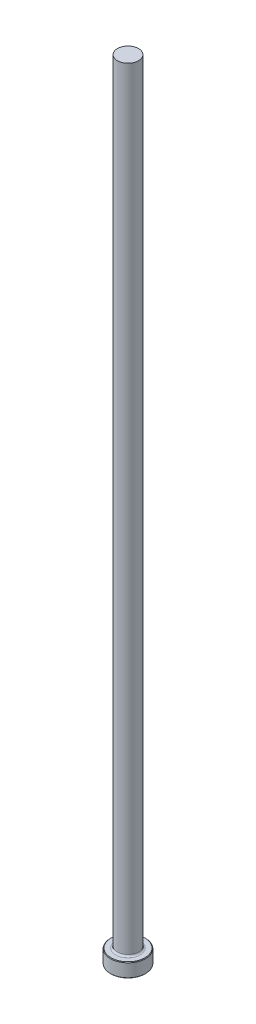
ISO-10303-21;
HEADER;
FILE_DESCRIPTION(('STEP AP214'),'2;1');
FILE_NAME('part.step','',(''),(''),'','','');
FILE_SCHEMA(('AUTOMOTIVE_DESIGN { 1 0 10303 214 1 1 1 1 }'));
ENDSEC;
DATA;
#1=APPLICATION_CONTEXT('core data for automotive mechanical design processes');
#2=APPLICATION_PROTOCOL_DEFINITION('international standard','automotive_design',2000,#1);
#3=PRODUCT_CONTEXT('',#1,'mechanical');
#4=PRODUCT('Part','Part','',(#3));
#5=PRODUCT_RELATED_PRODUCT_CATEGORY('part','',(#4));
#6=PRODUCT_DEFINITION_FORMATION('','',#4);
#7=PRODUCT_DEFINITION_CONTEXT('part definition',#1,'design');
#8=PRODUCT_DEFINITION('design','',#6,#7);
#9=PRODUCT_DEFINITION_SHAPE('','',#8);
#10=(LENGTH_UNIT() NAMED_UNIT(*) SI_UNIT(.MILLI.,.METRE.));
#11=(NAMED_UNIT(*) PLANE_ANGLE_UNIT() SI_UNIT($,.RADIAN.));
#12=(NAMED_UNIT(*) SI_UNIT($,.STERADIAN.) SOLID_ANGLE_UNIT());
#13=UNCERTAINTY_MEASURE_WITH_UNIT(LENGTH_MEASURE(1.E-05),#10,'distance_accuracy_value','');
#14=(GEOMETRIC_REPRESENTATION_CONTEXT(3) GLOBAL_UNCERTAINTY_ASSIGNED_CONTEXT((#13)) GLOBAL_UNIT_ASSIGNED_CONTEXT((#10,
#11,#12)) REPRESENTATION_CONTEXT('',''));
#15=CARTESIAN_POINT('',(0.,0.,0.));
#16=DIRECTION('',(0.,0.,1.));
#17=DIRECTION('',(1.,0.,0.));
#18=AXIS2_PLACEMENT_3D('',#15,#16,#17);
#19=CARTESIAN_POINT('',(0.,0.,0.));
#20=DIRECTION('',(0.,-1.,0.));
#21=DIRECTION('',(0.,0.,-1.));
#22=AXIS2_PLACEMENT_3D('',#19,#20,#21);
#23=PLANE('',#22);
#24=CARTESIAN_POINT('',(0.,0.,0.));
#25=DIRECTION('',(0.,-1.,0.));
#26=DIRECTION('',(0.,0.,-1.));
#27=AXIS2_PLACEMENT_3D('',#24,#25,#26);
#28=CIRCLE('',#27,7.68349999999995);
#29=CARTESIAN_POINT('',(0.,0.,-7.68349999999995));
#30=VERTEX_POINT('',#29);
#31=EDGE_CURVE('E46',#30,#30,#28,.T.);
#32=ORIENTED_EDGE('',*,*,#31,.T.);
#33=EDGE_LOOP('',(#32));
#34=FACE_BOUND('',#33,.T.);
#35=ADVANCED_FACE('F35',(#34),#23,.T.);
#36=CARTESIAN_POINT('',(0.,259.958771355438,0.));
#37=DIRECTION('',(0.,1.,0.));
#38=DIRECTION('',(0.,0.,1.));
#39=AXIS2_PLACEMENT_3D('',#36,#37,#38);
#40=CYLINDRICAL_SURFACE('',#39,7.93749999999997);
#41=CARTESIAN_POINT('',(0.,6.09599999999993,0.));
#42=DIRECTION('',(0.,1.,0.));
#43=DIRECTION('',(0.,0.,1.));
#44=AXIS2_PLACEMENT_3D('',#41,#42,#43);
#45=CIRCLE('',#44,7.93749999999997);
#46=CARTESIAN_POINT('',(0.,6.09599999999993,7.93749999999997));
#47=VERTEX_POINT('',#46);
#48=EDGE_CURVE('E50',#47,#47,#45,.F.);
#49=ORIENTED_EDGE('',*,*,#48,.T.);
#50=EDGE_LOOP('',(#49));
#51=FACE_BOUND('',#50,.T.);
#52=CARTESIAN_POINT('',(0.,0.254000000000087,0.));
#53=DIRECTION('',(0.,-1.,0.));
#54=DIRECTION('',(0.,0.,-1.));
#55=AXIS2_PLACEMENT_3D('',#52,#53,#54);
#56=CIRCLE('',#55,7.93749999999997);
#57=CARTESIAN_POINT('',(0.,0.254000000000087,-7.93749999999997));
#58=VERTEX_POINT('',#57);
#59=EDGE_CURVE('E55',#58,#58,#56,.F.);
#60=ORIENTED_EDGE('',*,*,#59,.T.);
#61=EDGE_LOOP('',(#60));
#62=FACE_BOUND('',#61,.T.);
#63=ADVANCED_FACE('F77',(#51,#62),#40,.T.);
#64=CARTESIAN_POINT('',(-7.93749999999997,6.35,0.));
#65=DIRECTION('',(0.,1.,0.));
#66=DIRECTION('',(0.,0.,1.));
#67=AXIS2_PLACEMENT_3D('',#64,#65,#66);
#68=PLANE('',#67);
#69=CARTESIAN_POINT('',(0.,6.35,0.));
#70=DIRECTION('',(0.,1.,0.));
#71=DIRECTION('',(0.,0.,1.));
#72=AXIS2_PLACEMENT_3D('',#69,#70,#71);
#73=CIRCLE('',#72,5.52449999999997);
#74=CARTESIAN_POINT('',(0.,6.35,5.52449999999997));
#75=VERTEX_POINT('',#74);
#76=EDGE_CURVE('E10',#75,#75,#73,.F.);
#77=ORIENTED_EDGE('',*,*,#76,.T.);
#78=EDGE_LOOP('',(#77));
#79=FACE_BOUND('',#78,.T.);
#80=CARTESIAN_POINT('',(0.,6.35,0.));
#81=DIRECTION('',(0.,1.,0.));
#82=DIRECTION('',(0.,0.,1.));
#83=AXIS2_PLACEMENT_3D('',#80,#81,#82);
#84=CIRCLE('',#83,7.68349999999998);
#85=CARTESIAN_POINT('',(0.,6.35,7.68349999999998));
#86=VERTEX_POINT('',#85);
#87=EDGE_CURVE('E58',#86,#86,#84,.T.);
#88=ORIENTED_EDGE('',*,*,#87,.T.);
#89=EDGE_LOOP('',(#88));
#90=FACE_BOUND('',#89,.T.);
#91=ADVANCED_FACE('F69',(#79,#90),#68,.T.);
#92=CARTESIAN_POINT('',(0.,259.958771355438,0.));
#93=DIRECTION('',(0.,1.,0.));
#94=DIRECTION('',(0.,0.,1.));
#95=AXIS2_PLACEMENT_3D('',#92,#93,#94);
#96=CYLINDRICAL_SURFACE('',#95,4.76249999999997);
#97=CARTESIAN_POINT('',(0.,7.11200000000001,0.));
#98=DIRECTION('',(0.,1.,0.));
#99=DIRECTION('',(0.,0.,1.));
#100=AXIS2_PLACEMENT_3D('',#97,#98,#99);
#101=CIRCLE('',#100,4.76249999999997);
#102=CARTESIAN_POINT('',(0.,7.11200000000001,4.76249999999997));
#103=VERTEX_POINT('',#102);
#104=EDGE_CURVE('E42',#103,#103,#101,.T.);
#105=ORIENTED_EDGE('',*,*,#104,.T.);
#106=EDGE_LOOP('',(#105));
#107=FACE_BOUND('',#106,.T.);
#108=CARTESIAN_POINT('',(0.,355.6,0.));
#109=DIRECTION('',(0.,1.,0.));
#110=DIRECTION('',(0.,0.,1.));
#111=AXIS2_PLACEMENT_3D('',#108,#109,#110);
#112=CIRCLE('',#111,4.76249999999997);
#113=CARTESIAN_POINT('',(0.,355.6,4.76249999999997));
#114=VERTEX_POINT('',#113);
#115=EDGE_CURVE('E61',#114,#114,#112,.T.);
#116=ORIENTED_EDGE('',*,*,#115,.F.);
#117=EDGE_LOOP('',(#116));
#118=FACE_BOUND('',#117,.T.);
#119=ADVANCED_FACE('F67',(#107,#118),#96,.T.);
#120=CARTESIAN_POINT('',(-4.76249999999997,355.6,0.));
#121=DIRECTION('',(0.,1.,0.));
#122=DIRECTION('',(0.,0.,1.));
#123=AXIS2_PLACEMENT_3D('',#120,#121,#122);
#124=PLANE('',#123);
#125=ORIENTED_EDGE('',*,*,#115,.T.);
#126=EDGE_LOOP('',(#125));
#127=FACE_BOUND('',#126,.T.);
#128=ADVANCED_FACE('F65',(#127),#124,.T.);
#129=CARTESIAN_POINT('',(0.,6.35000000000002,0.));
#130=DIRECTION('',(0.,-1.,0.));
#131=DIRECTION('',(0.,0.,-1.));
#132=AXIS2_PLACEMENT_3D('',#129,#130,#131);
#133=CONICAL_SURFACE('',#132,7.68349999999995,0.785398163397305);
#134=ORIENTED_EDGE('',*,*,#48,.F.);
#135=EDGE_LOOP('',(#134));
#136=FACE_BOUND('',#135,.T.);
#137=ORIENTED_EDGE('',*,*,#87,.F.);
#138=EDGE_LOOP('',(#137));
#139=FACE_BOUND('',#138,.T.);
#140=ADVANCED_FACE('F75',(#136,#139),#133,.T.);
#141=CARTESIAN_POINT('',(0.,0.254000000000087,0.));
#142=DIRECTION('',(0.,1.,0.));
#143=DIRECTION('',(0.,0.,1.));
#144=AXIS2_PLACEMENT_3D('',#141,#142,#143);
#145=CONICAL_SURFACE('',#144,7.93749999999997,0.785398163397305);
#146=ORIENTED_EDGE('',*,*,#31,.F.);
#147=EDGE_LOOP('',(#146));
#148=FACE_BOUND('',#147,.T.);
#149=ORIENTED_EDGE('',*,*,#59,.F.);
#150=EDGE_LOOP('',(#149));
#151=FACE_BOUND('',#150,.T.);
#152=ADVANCED_FACE('F89',(#148,#151),#145,.T.);
#153=CARTESIAN_POINT('',(0.,7.11200000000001,0.));
#154=DIRECTION('',(0.,1.,0.));
#155=DIRECTION('',(0.,0.,1.));
#156=AXIS2_PLACEMENT_3D('',#153,#154,#155);
#157=TOROIDAL_SURFACE('',#156,5.52449999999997,0.762);
#158=ORIENTED_EDGE('',*,*,#76,.F.);
#159=EDGE_LOOP('',(#158));
#160=FACE_BOUND('',#159,.T.);
#161=ORIENTED_EDGE('',*,*,#104,.F.);
#162=EDGE_LOOP('',(#161));
#163=FACE_BOUND('',#162,.T.);
#164=ADVANCED_FACE('F37',(#160,#163),#157,.F.);
#165=CLOSED_SHELL('',(#35,#63,#91,#119,#128,#140,#152,#164));
#166=MANIFOLD_SOLID_BREP('B2',#165);
#167=ADVANCED_BREP_SHAPE_REPRESENTATION('',(#18,#166),#14);
#168=SHAPE_DEFINITION_REPRESENTATION(#9,#167);
ENDSEC;
END-ISO-10303-21;
